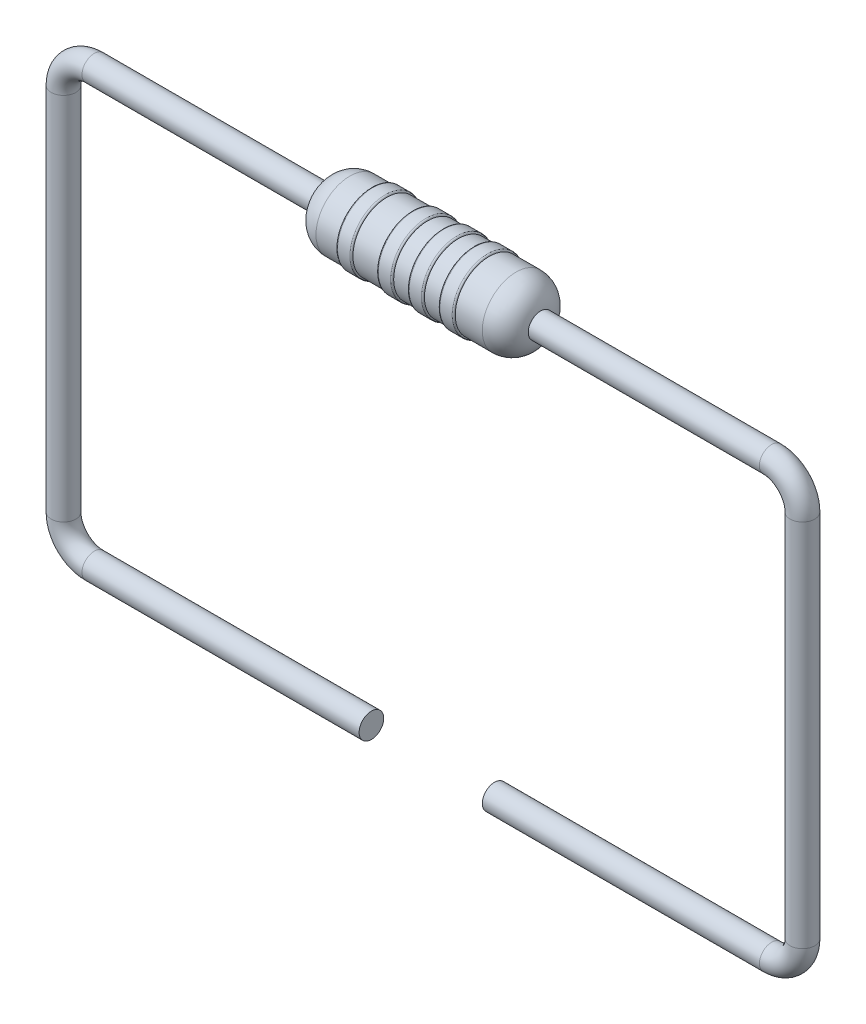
ISO-10303-21;
HEADER;
FILE_DESCRIPTION(('STEP AP214'),'2;1');
FILE_NAME('part.step','',(''),(''),'','','');
FILE_SCHEMA(('AUTOMOTIVE_DESIGN { 1 0 10303 214 1 1 1 1 }'));
ENDSEC;
DATA;
#1=APPLICATION_CONTEXT('core data for automotive mechanical design processes');
#2=APPLICATION_PROTOCOL_DEFINITION('international standard','automotive_design',2000,#1);
#3=PRODUCT_CONTEXT('',#1,'mechanical');
#4=PRODUCT('Part','Part','',(#3));
#5=PRODUCT_RELATED_PRODUCT_CATEGORY('part','',(#4));
#6=PRODUCT_DEFINITION_FORMATION('','',#4);
#7=PRODUCT_DEFINITION_CONTEXT('part definition',#1,'design');
#8=PRODUCT_DEFINITION('design','',#6,#7);
#9=PRODUCT_DEFINITION_SHAPE('','',#8);
#10=(LENGTH_UNIT() NAMED_UNIT(*) SI_UNIT(.MILLI.,.METRE.));
#11=(NAMED_UNIT(*) PLANE_ANGLE_UNIT() SI_UNIT($,.RADIAN.));
#12=(NAMED_UNIT(*) SI_UNIT($,.STERADIAN.) SOLID_ANGLE_UNIT());
#13=UNCERTAINTY_MEASURE_WITH_UNIT(LENGTH_MEASURE(1.E-05),#10,'distance_accuracy_value','');
#14=(GEOMETRIC_REPRESENTATION_CONTEXT(3) GLOBAL_UNCERTAINTY_ASSIGNED_CONTEXT((#13)) GLOBAL_UNIT_ASSIGNED_CONTEXT((#10,
#11,#12)) REPRESENTATION_CONTEXT('',''));
#15=CARTESIAN_POINT('',(0.,0.,0.));
#16=DIRECTION('',(0.,0.,1.));
#17=DIRECTION('',(1.,0.,0.));
#18=AXIS2_PLACEMENT_3D('',#15,#16,#17);
#19=CARTESIAN_POINT('',(-54.2686615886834,0.,0.));
#20=DIRECTION('',(-1.,0.,0.));
#21=DIRECTION('',(0.,0.,1.));
#22=AXIS2_PLACEMENT_3D('',#19,#20,#21);
#23=CYLINDRICAL_SURFACE('',#22,1.1);
#24=CARTESIAN_POINT('',(0.322975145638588,0.,0.));
#25=DIRECTION('',(-1.,0.,0.));
#26=DIRECTION('',(0.,0.,1.));
#27=AXIS2_PLACEMENT_3D('',#24,#25,#26);
#28=CIRCLE('',#27,1.1);
#29=CARTESIAN_POINT('',(0.322975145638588,0.,1.1));
#30=VERTEX_POINT('',#29);
#31=EDGE_CURVE('E104',#30,#30,#28,.T.);
#32=ORIENTED_EDGE('',*,*,#31,.T.);
#33=EDGE_LOOP('',(#32));
#34=FACE_BOUND('',#33,.T.);
#35=CARTESIAN_POINT('',(-0.177024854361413,0.,0.));
#36=DIRECTION('',(1.,0.,0.));
#37=DIRECTION('',(0.,0.,-1.));
#38=AXIS2_PLACEMENT_3D('',#35,#36,#37);
#39=CIRCLE('',#38,1.1);
#40=CARTESIAN_POINT('',(-0.177024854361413,0.,-1.1));
#41=VERTEX_POINT('',#40);
#42=EDGE_CURVE('E116',#41,#41,#39,.T.);
#43=ORIENTED_EDGE('',*,*,#42,.T.);
#44=EDGE_LOOP('',(#43));
#45=FACE_BOUND('',#44,.T.);
#46=ADVANCED_FACE('F49',(#34,#45),#23,.T.);
#47=CARTESIAN_POINT('',(4.3261723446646,0.,0.));
#48=DIRECTION('',(1.,0.,0.));
#49=DIRECTION('',(0.,0.,-1.));
#50=AXIS2_PLACEMENT_3D('',#47,#48,#49);
#51=CYLINDRICAL_SURFACE('',#50,1.15);
#52=CARTESIAN_POINT('',(-0.627024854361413,0.,0.));
#53=DIRECTION('',(-1.,0.,0.));
#54=DIRECTION('',(0.,0.,1.));
#55=AXIS2_PLACEMENT_3D('',#52,#53,#54);
#56=CIRCLE('',#55,1.15);
#57=CARTESIAN_POINT('',(-0.627024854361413,0.,1.15));
#58=VERTEX_POINT('',#57);
#59=EDGE_CURVE('E73',#58,#58,#56,.F.);
#60=ORIENTED_EDGE('',*,*,#59,.T.);
#61=EDGE_LOOP('',(#60));
#62=FACE_BOUND('',#61,.T.);
#63=CARTESIAN_POINT('',(-0.227024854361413,0.,0.));
#64=DIRECTION('',(1.,0.,0.));
#65=DIRECTION('',(0.,0.,-1.));
#66=AXIS2_PLACEMENT_3D('',#63,#64,#65);
#67=CIRCLE('',#66,1.15);
#68=CARTESIAN_POINT('',(-0.227024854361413,0.,-1.15));
#69=VERTEX_POINT('',#68);
#70=EDGE_CURVE('E77',#69,#69,#67,.F.);
#71=ORIENTED_EDGE('',*,*,#70,.T.);
#72=EDGE_LOOP('',(#71));
#73=FACE_BOUND('',#72,.T.);
#74=ADVANCED_FACE('F194',(#62,#73),#51,.T.);
#75=CARTESIAN_POINT('',(-1.5,0.,0.));
#76=DIRECTION('',(1.,0.,0.));
#77=DIRECTION('',(0.,0.,-1.));
#78=AXIS2_PLACEMENT_3D('',#75,#76,#77);
#79=CIRCLE('',#78,1.1);
#80=CARTESIAN_POINT('',(-1.5,0.,-1.1));
#81=VERTEX_POINT('',#80);
#82=EDGE_CURVE('E95',#81,#81,#79,.T.);
#83=ORIENTED_EDGE('',*,*,#82,.T.);
#84=EDGE_LOOP('',(#83));
#85=FACE_BOUND('',#84,.T.);
#86=CARTESIAN_POINT('',(-0.677024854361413,0.,0.));
#87=DIRECTION('',(-1.,0.,0.));
#88=DIRECTION('',(0.,0.,1.));
#89=AXIS2_PLACEMENT_3D('',#86,#87,#88);
#90=CIRCLE('',#89,1.1);
#91=CARTESIAN_POINT('',(-0.677024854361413,0.,1.1));
#92=VERTEX_POINT('',#91);
#93=EDGE_CURVE('E112',#92,#92,#90,.T.);
#94=ORIENTED_EDGE('',*,*,#93,.T.);
#95=EDGE_LOOP('',(#94));
#96=FACE_BOUND('',#95,.T.);
#97=ADVANCED_FACE('F197',(#85,#96),#23,.T.);
#98=CARTESIAN_POINT('',(4.3261723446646,0.,0.));
#99=DIRECTION('',(1.,0.,0.));
#100=DIRECTION('',(0.,0.,-1.));
#101=AXIS2_PLACEMENT_3D('',#98,#99,#100);
#102=CYLINDRICAL_SURFACE('',#101,1.15);
#103=CARTESIAN_POINT('',(0.372975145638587,0.,0.));
#104=DIRECTION('',(-1.,0.,0.));
#105=DIRECTION('',(0.,0.,1.));
#106=AXIS2_PLACEMENT_3D('',#103,#104,#105);
#107=CIRCLE('',#106,1.15);
#108=CARTESIAN_POINT('',(0.372975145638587,0.,1.15));
#109=VERTEX_POINT('',#108);
#110=EDGE_CURVE('E63',#109,#109,#107,.F.);
#111=ORIENTED_EDGE('',*,*,#110,.T.);
#112=EDGE_LOOP('',(#111));
#113=FACE_BOUND('',#112,.T.);
#114=CARTESIAN_POINT('',(0.772975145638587,0.,0.));
#115=DIRECTION('',(1.,0.,0.));
#116=DIRECTION('',(0.,0.,-1.));
#117=AXIS2_PLACEMENT_3D('',#114,#115,#116);
#118=CIRCLE('',#117,1.15);
#119=CARTESIAN_POINT('',(0.772975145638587,0.,-1.15));
#120=VERTEX_POINT('',#119);
#121=EDGE_CURVE('E69',#120,#120,#118,.F.);
#122=ORIENTED_EDGE('',*,*,#121,.T.);
#123=EDGE_LOOP('',(#122));
#124=FACE_BOUND('',#123,.T.);
#125=ADVANCED_FACE('F208',(#113,#124),#102,.T.);
#126=CARTESIAN_POINT('',(1.32297514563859,0.,0.));
#127=DIRECTION('',(-1.,0.,0.));
#128=DIRECTION('',(0.,0.,1.));
#129=AXIS2_PLACEMENT_3D('',#126,#127,#128);
#130=CIRCLE('',#129,1.1);
#131=CARTESIAN_POINT('',(1.32297514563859,0.,1.1));
#132=VERTEX_POINT('',#131);
#133=EDGE_CURVE('E94',#132,#132,#130,.T.);
#134=ORIENTED_EDGE('',*,*,#133,.T.);
#135=EDGE_LOOP('',(#134));
#136=FACE_BOUND('',#135,.T.);
#137=CARTESIAN_POINT('',(0.822975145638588,0.,0.));
#138=DIRECTION('',(1.,0.,0.));
#139=DIRECTION('',(0.,0.,-1.));
#140=AXIS2_PLACEMENT_3D('',#137,#138,#139);
#141=CIRCLE('',#140,1.1);
#142=CARTESIAN_POINT('',(0.822975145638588,0.,-1.1));
#143=VERTEX_POINT('',#142);
#144=EDGE_CURVE('E108',#143,#143,#141,.T.);
#145=ORIENTED_EDGE('',*,*,#144,.T.);
#146=EDGE_LOOP('',(#145));
#147=FACE_BOUND('',#146,.T.);
#148=ADVANCED_FACE('F198',(#136,#147),#23,.T.);
#149=CARTESIAN_POINT('',(4.3261723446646,0.,0.));
#150=DIRECTION('',(1.,0.,0.));
#151=DIRECTION('',(0.,0.,-1.));
#152=AXIS2_PLACEMENT_3D('',#149,#150,#151);
#153=CYLINDRICAL_SURFACE('',#152,1.15);
#154=CARTESIAN_POINT('',(1.37297514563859,0.,0.));
#155=DIRECTION('',(-1.,0.,0.));
#156=DIRECTION('',(0.,0.,1.));
#157=AXIS2_PLACEMENT_3D('',#154,#155,#156);
#158=CIRCLE('',#157,1.15);
#159=CARTESIAN_POINT('',(1.37297514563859,0.,1.15));
#160=VERTEX_POINT('',#159);
#161=EDGE_CURVE('E10',#160,#160,#158,.F.);
#162=ORIENTED_EDGE('',*,*,#161,.T.);
#163=EDGE_LOOP('',(#162));
#164=FACE_BOUND('',#163,.T.);
#165=CARTESIAN_POINT('',(1.77297514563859,0.,0.));
#166=DIRECTION('',(1.,0.,0.));
#167=DIRECTION('',(0.,0.,-1.));
#168=AXIS2_PLACEMENT_3D('',#165,#166,#167);
#169=CIRCLE('',#168,1.15);
#170=CARTESIAN_POINT('',(1.77297514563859,0.,-1.15));
#171=VERTEX_POINT('',#170);
#172=EDGE_CURVE('E58',#171,#171,#169,.F.);
#173=ORIENTED_EDGE('',*,*,#172,.T.);
#174=EDGE_LOOP('',(#173));
#175=FACE_BOUND('',#174,.T.);
#176=ADVANCED_FACE('F212',(#164,#175),#153,.T.);
#177=CARTESIAN_POINT('',(2.7,0.,0.));
#178=DIRECTION('',(-1.,0.,0.));
#179=DIRECTION('',(0.,0.,1.));
#180=AXIS2_PLACEMENT_3D('',#177,#178,#179);
#181=DEGENERATE_TOROIDAL_SURFACE('',#180,0.3,0.8,.T.);
#182=CARTESIAN_POINT('',(3.49372539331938,0.,0.));
#183=DIRECTION('',(-1.,0.,0.));
#184=DIRECTION('',(0.,0.,1.));
#185=AXIS2_PLACEMENT_3D('',#182,#183,#184);
#186=CIRCLE('',#185,0.4);
#187=CARTESIAN_POINT('',(3.49372539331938,0.,0.4));
#188=VERTEX_POINT('',#187);
#189=EDGE_CURVE('E99',#188,#188,#186,.T.);
#190=ORIENTED_EDGE('',*,*,#189,.T.);
#191=EDGE_LOOP('',(#190));
#192=FACE_BOUND('',#191,.T.);
#193=CARTESIAN_POINT('',(2.69999999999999,0.,0.));
#194=DIRECTION('',(-1.,0.,0.));
#195=DIRECTION('',(0.,0.,1.));
#196=AXIS2_PLACEMENT_3D('',#193,#194,#195);
#197=CIRCLE('',#196,1.1);
#198=CARTESIAN_POINT('',(2.69999999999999,0.,1.1));
#199=VERTEX_POINT('',#198);
#200=EDGE_CURVE('E89',#199,#199,#197,.T.);
#201=ORIENTED_EDGE('',*,*,#200,.F.);
#202=EDGE_LOOP('',(#201));
#203=FACE_BOUND('',#202,.T.);
#204=ADVANCED_FACE('F219',(#192,#203),#181,.T.);
#205=CARTESIAN_POINT('',(1.82297514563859,0.,0.));
#206=DIRECTION('',(1.,0.,0.));
#207=DIRECTION('',(0.,0.,-1.));
#208=AXIS2_PLACEMENT_3D('',#205,#206,#207);
#209=CIRCLE('',#208,1.1);
#210=CARTESIAN_POINT('',(1.82297514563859,0.,-1.1));
#211=VERTEX_POINT('',#210);
#212=EDGE_CURVE('E100',#211,#211,#209,.T.);
#213=ORIENTED_EDGE('',*,*,#212,.T.);
#214=EDGE_LOOP('',(#213));
#215=FACE_BOUND('',#214,.T.);
#216=ORIENTED_EDGE('',*,*,#200,.T.);
#217=EDGE_LOOP('',(#216));
#218=FACE_BOUND('',#217,.T.);
#219=ADVANCED_FACE('F214',(#215,#218),#23,.T.);
#220=CARTESIAN_POINT('',(4.3261723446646,0.,0.));
#221=DIRECTION('',(1.,0.,0.));
#222=DIRECTION('',(0.,0.,-1.));
#223=AXIS2_PLACEMENT_3D('',#220,#221,#222);
#224=CYLINDRICAL_SURFACE('',#223,1.15);
#225=CARTESIAN_POINT('',(-1.95,0.,0.));
#226=DIRECTION('',(-1.,0.,0.));
#227=DIRECTION('',(0.,0.,1.));
#228=AXIS2_PLACEMENT_3D('',#225,#226,#227);
#229=CIRCLE('',#228,1.15);
#230=CARTESIAN_POINT('',(-1.95,0.,1.15));
#231=VERTEX_POINT('',#230);
#232=EDGE_CURVE('E81',#231,#231,#229,.F.);
#233=ORIENTED_EDGE('',*,*,#232,.T.);
#234=EDGE_LOOP('',(#233));
#235=FACE_BOUND('',#234,.T.);
#236=CARTESIAN_POINT('',(-1.55,0.,0.));
#237=DIRECTION('',(1.,0.,0.));
#238=DIRECTION('',(0.,0.,-1.));
#239=AXIS2_PLACEMENT_3D('',#236,#237,#238);
#240=CIRCLE('',#239,1.15);
#241=CARTESIAN_POINT('',(-1.55,0.,-1.15));
#242=VERTEX_POINT('',#241);
#243=EDGE_CURVE('E85',#242,#242,#240,.F.);
#244=ORIENTED_EDGE('',*,*,#243,.T.);
#245=EDGE_LOOP('',(#244));
#246=FACE_BOUND('',#245,.T.);
#247=ADVANCED_FACE('F225',(#235,#246),#224,.T.);
#248=CARTESIAN_POINT('',(-2.7,0.,0.));
#249=DIRECTION('',(-1.,0.,0.));
#250=DIRECTION('',(0.,0.,1.));
#251=AXIS2_PLACEMENT_3D('',#248,#249,#250);
#252=DEGENERATE_TOROIDAL_SURFACE('',#251,0.3,0.8,.T.);
#253=CARTESIAN_POINT('',(-3.49372539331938,0.,0.));
#254=DIRECTION('',(1.,0.,0.));
#255=DIRECTION('',(0.,0.,-1.));
#256=AXIS2_PLACEMENT_3D('',#253,#254,#255);
#257=CIRCLE('',#256,0.4);
#258=CARTESIAN_POINT('',(-3.49372539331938,0.,-0.4));
#259=VERTEX_POINT('',#258);
#260=EDGE_CURVE('E53',#259,#259,#257,.T.);
#261=ORIENTED_EDGE('',*,*,#260,.T.);
#262=EDGE_LOOP('',(#261));
#263=FACE_BOUND('',#262,.T.);
#264=CARTESIAN_POINT('',(-2.69999999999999,0.,0.));
#265=DIRECTION('',(-1.,0.,0.));
#266=DIRECTION('',(0.,0.,1.));
#267=AXIS2_PLACEMENT_3D('',#264,#265,#266);
#268=CIRCLE('',#267,1.1);
#269=CARTESIAN_POINT('',(-2.69999999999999,0.,1.1));
#270=VERTEX_POINT('',#269);
#271=EDGE_CURVE('E120',#270,#270,#268,.T.);
#272=ORIENTED_EDGE('',*,*,#271,.T.);
#273=EDGE_LOOP('',(#272));
#274=FACE_BOUND('',#273,.T.);
#275=ADVANCED_FACE('F231',(#263,#274),#252,.T.);
#276=CARTESIAN_POINT('',(-2.,0.,0.));
#277=DIRECTION('',(-1.,0.,0.));
#278=DIRECTION('',(0.,0.,1.));
#279=AXIS2_PLACEMENT_3D('',#276,#277,#278);
#280=CIRCLE('',#279,1.1);
#281=CARTESIAN_POINT('',(-2.,0.,1.1));
#282=VERTEX_POINT('',#281);
#283=EDGE_CURVE('E90',#282,#282,#280,.T.);
#284=ORIENTED_EDGE('',*,*,#283,.T.);
#285=EDGE_LOOP('',(#284));
#286=FACE_BOUND('',#285,.T.);
#287=ORIENTED_EDGE('',*,*,#271,.F.);
#288=EDGE_LOOP('',(#287));
#289=FACE_BOUND('',#288,.T.);
#290=ADVANCED_FACE('F210',(#286,#289),#23,.T.);
#291=CARTESIAN_POINT('',(-1.95,0.,0.));
#292=DIRECTION('',(-1.,0.,0.));
#293=DIRECTION('',(0.,0.,1.));
#294=AXIS2_PLACEMENT_3D('',#291,#292,#293);
#295=TOROIDAL_SURFACE('',#294,1.1,0.05);
#296=ORIENTED_EDGE('',*,*,#283,.F.);
#297=EDGE_LOOP('',(#296));
#298=FACE_BOUND('',#297,.T.);
#299=ORIENTED_EDGE('',*,*,#232,.F.);
#300=EDGE_LOOP('',(#299));
#301=FACE_BOUND('',#300,.T.);
#302=ADVANCED_FACE('F236',(#298,#301),#295,.T.);
#303=CARTESIAN_POINT('',(-1.55,0.,0.));
#304=DIRECTION('',(1.,0.,0.));
#305=DIRECTION('',(0.,0.,-1.));
#306=AXIS2_PLACEMENT_3D('',#303,#304,#305);
#307=TOROIDAL_SURFACE('',#306,1.1,0.05);
#308=ORIENTED_EDGE('',*,*,#243,.F.);
#309=EDGE_LOOP('',(#308));
#310=FACE_BOUND('',#309,.T.);
#311=ORIENTED_EDGE('',*,*,#82,.F.);
#312=EDGE_LOOP('',(#311));
#313=FACE_BOUND('',#312,.T.);
#314=ADVANCED_FACE('F242',(#310,#313),#307,.T.);
#315=CARTESIAN_POINT('',(-0.627024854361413,0.,0.));
#316=DIRECTION('',(-1.,0.,0.));
#317=DIRECTION('',(0.,0.,1.));
#318=AXIS2_PLACEMENT_3D('',#315,#316,#317);
#319=TOROIDAL_SURFACE('',#318,1.1,0.05);
#320=ORIENTED_EDGE('',*,*,#93,.F.);
#321=EDGE_LOOP('',(#320));
#322=FACE_BOUND('',#321,.T.);
#323=ORIENTED_EDGE('',*,*,#59,.F.);
#324=EDGE_LOOP('',(#323));
#325=FACE_BOUND('',#324,.T.);
#326=ADVANCED_FACE('F257',(#322,#325),#319,.T.);
#327=CARTESIAN_POINT('',(-0.227024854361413,0.,0.));
#328=DIRECTION('',(1.,0.,0.));
#329=DIRECTION('',(0.,0.,-1.));
#330=AXIS2_PLACEMENT_3D('',#327,#328,#329);
#331=TOROIDAL_SURFACE('',#330,1.1,0.05);
#332=ORIENTED_EDGE('',*,*,#70,.F.);
#333=EDGE_LOOP('',(#332));
#334=FACE_BOUND('',#333,.T.);
#335=ORIENTED_EDGE('',*,*,#42,.F.);
#336=EDGE_LOOP('',(#335));
#337=FACE_BOUND('',#336,.T.);
#338=ADVANCED_FACE('F265',(#334,#337),#331,.T.);
#339=CARTESIAN_POINT('',(0.372975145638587,0.,0.));
#340=DIRECTION('',(-1.,0.,0.));
#341=DIRECTION('',(0.,0.,1.));
#342=AXIS2_PLACEMENT_3D('',#339,#340,#341);
#343=TOROIDAL_SURFACE('',#342,1.1,0.05);
#344=ORIENTED_EDGE('',*,*,#31,.F.);
#345=EDGE_LOOP('',(#344));
#346=FACE_BOUND('',#345,.T.);
#347=ORIENTED_EDGE('',*,*,#110,.F.);
#348=EDGE_LOOP('',(#347));
#349=FACE_BOUND('',#348,.T.);
#350=ADVANCED_FACE('F273',(#346,#349),#343,.T.);
#351=CARTESIAN_POINT('',(0.772975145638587,0.,0.));
#352=DIRECTION('',(1.,0.,0.));
#353=DIRECTION('',(0.,0.,-1.));
#354=AXIS2_PLACEMENT_3D('',#351,#352,#353);
#355=TOROIDAL_SURFACE('',#354,1.1,0.05);
#356=ORIENTED_EDGE('',*,*,#121,.F.);
#357=EDGE_LOOP('',(#356));
#358=FACE_BOUND('',#357,.T.);
#359=ORIENTED_EDGE('',*,*,#144,.F.);
#360=EDGE_LOOP('',(#359));
#361=FACE_BOUND('',#360,.T.);
#362=ADVANCED_FACE('F279',(#358,#361),#355,.T.);
#363=CARTESIAN_POINT('',(1.37297514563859,0.,0.));
#364=DIRECTION('',(-1.,0.,0.));
#365=DIRECTION('',(0.,0.,1.));
#366=AXIS2_PLACEMENT_3D('',#363,#364,#365);
#367=TOROIDAL_SURFACE('',#366,1.1,0.05);
#368=ORIENTED_EDGE('',*,*,#133,.F.);
#369=EDGE_LOOP('',(#368));
#370=FACE_BOUND('',#369,.T.);
#371=ORIENTED_EDGE('',*,*,#161,.F.);
#372=EDGE_LOOP('',(#371));
#373=FACE_BOUND('',#372,.T.);
#374=ADVANCED_FACE('F284',(#370,#373),#367,.T.);
#375=CARTESIAN_POINT('',(1.77297514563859,0.,0.));
#376=DIRECTION('',(1.,0.,0.));
#377=DIRECTION('',(0.,0.,-1.));
#378=AXIS2_PLACEMENT_3D('',#375,#376,#377);
#379=TOROIDAL_SURFACE('',#378,1.1,0.05);
#380=ORIENTED_EDGE('',*,*,#172,.F.);
#381=EDGE_LOOP('',(#380));
#382=FACE_BOUND('',#381,.T.);
#383=ORIENTED_EDGE('',*,*,#212,.F.);
#384=EDGE_LOOP('',(#383));
#385=FACE_BOUND('',#384,.T.);
#386=ADVANCED_FACE('F51',(#382,#385),#379,.T.);
#387=CARTESIAN_POINT('',(-2.,-14.,0.));
#388=DIRECTION('',(1.,0.,0.));
#389=DIRECTION('',(0.,0.,-1.));
#390=AXIS2_PLACEMENT_3D('',#387,#388,#389);
#391=PLANE('',#390);
#392=CARTESIAN_POINT('',(-2.,-14.,0.));
#393=DIRECTION('',(1.,0.,0.));
#394=DIRECTION('',(0.,0.,-1.));
#395=AXIS2_PLACEMENT_3D('',#392,#393,#394);
#396=CIRCLE('',#395,0.4);
#397=CARTESIAN_POINT('',(-2.,-14.,-0.4));
#398=VERTEX_POINT('',#397);
#399=EDGE_CURVE('E133',#398,#398,#396,.T.);
#400=ORIENTED_EDGE('',*,*,#399,.T.);
#401=EDGE_LOOP('',(#400));
#402=FACE_BOUND('',#401,.T.);
#403=ADVANCED_FACE('F291',(#402),#391,.T.);
#404=CARTESIAN_POINT('',(-11.,-14.,0.));
#405=DIRECTION('',(1.,0.,0.));
#406=DIRECTION('',(0.,1.,0.));
#407=AXIS2_PLACEMENT_3D('',#404,#405,#406);
#408=CYLINDRICAL_SURFACE('',#407,0.4);
#409=ORIENTED_EDGE('',*,*,#399,.F.);
#410=EDGE_LOOP('',(#409));
#411=FACE_BOUND('',#410,.T.);
#412=CARTESIAN_POINT('',(-11.,-14.,0.));
#413=DIRECTION('',(1.,0.,0.));
#414=DIRECTION('',(0.,0.,-1.));
#415=AXIS2_PLACEMENT_3D('',#412,#413,#414);
#416=CIRCLE('',#415,0.4);
#417=CARTESIAN_POINT('',(-11.,-14.4,0.));
#418=VERTEX_POINT('',#417);
#419=EDGE_CURVE('E137',#418,#418,#416,.T.);
#420=ORIENTED_EDGE('',*,*,#419,.T.);
#421=EDGE_LOOP('',(#420));
#422=FACE_BOUND('',#421,.T.);
#423=ADVANCED_FACE('F298',(#411,#422),#408,.T.);
#424=CARTESIAN_POINT('',(-11.,-13.,0.));
#425=DIRECTION('',(0.,0.,1.));
#426=DIRECTION('',(1.,0.,0.));
#427=AXIS2_PLACEMENT_3D('',#424,#425,#426);
#428=TOROIDAL_SURFACE('',#427,1.,0.4);
#429=CARTESIAN_POINT('',(-12.,-13.,0.));
#430=DIRECTION('',(0.,-1.,0.));
#431=DIRECTION('',(0.,0.,-1.));
#432=AXIS2_PLACEMENT_3D('',#429,#430,#431);
#433=CIRCLE('',#432,0.4);
#434=CARTESIAN_POINT('',(-12.4,-13.,0.));
#435=VERTEX_POINT('',#434);
#436=EDGE_CURVE('E141',#435,#435,#433,.T.);
#437=CARTESIAN_POINT('',(-11.,-13.,0.));
#438=DIRECTION('',(0.,0.,1.));
#439=DIRECTION('',(1.,0.,0.));
#440=AXIS2_PLACEMENT_3D('',#437,#438,#439);
#441=CIRCLE('',#440,1.4);
#442=EDGE_CURVE('',#435,#418,#441,.T.);
#443=ORIENTED_EDGE('',*,*,#436,.T.);
#444=ORIENTED_EDGE('',*,*,#419,.F.);
#445=ORIENTED_EDGE('',*,*,#442,.T.);
#446=ORIENTED_EDGE('',*,*,#442,.F.);
#447=EDGE_LOOP('',(#443,#445,#444,#446));
#448=FACE_BOUND('',#447,.T.);
#449=ADVANCED_FACE('F308',(#448),#428,.T.);
#450=CARTESIAN_POINT('',(-12.,-1.,0.));
#451=DIRECTION('',(0.,-1.,0.));
#452=DIRECTION('',(0.,0.,-1.));
#453=AXIS2_PLACEMENT_3D('',#450,#451,#452);
#454=CYLINDRICAL_SURFACE('',#453,0.4);
#455=ORIENTED_EDGE('',*,*,#436,.F.);
#456=EDGE_LOOP('',(#455));
#457=FACE_BOUND('',#456,.T.);
#458=CARTESIAN_POINT('',(-12.,-1.,0.));
#459=DIRECTION('',(0.,-1.,0.));
#460=DIRECTION('',(0.,0.,-1.));
#461=AXIS2_PLACEMENT_3D('',#458,#459,#460);
#462=CIRCLE('',#461,0.4);
#463=CARTESIAN_POINT('',(-12.4,-0.999999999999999,0.));
#464=VERTEX_POINT('',#463);
#465=EDGE_CURVE('E145',#464,#464,#462,.T.);
#466=ORIENTED_EDGE('',*,*,#465,.T.);
#467=EDGE_LOOP('',(#466));
#468=FACE_BOUND('',#467,.T.);
#469=ADVANCED_FACE('F314',(#457,#468),#454,.T.);
#470=CARTESIAN_POINT('',(-11.,-1.,0.));
#471=DIRECTION('',(0.,0.,1.));
#472=DIRECTION('',(1.,0.,0.));
#473=AXIS2_PLACEMENT_3D('',#470,#471,#472);
#474=TOROIDAL_SURFACE('',#473,1.,0.4);
#475=CARTESIAN_POINT('',(-11.,0.,0.));
#476=DIRECTION('',(-1.,0.,0.));
#477=DIRECTION('',(0.,0.,-1.));
#478=AXIS2_PLACEMENT_3D('',#475,#476,#477);
#479=CIRCLE('',#478,0.4);
#480=CARTESIAN_POINT('',(-11.,0.400000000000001,0.));
#481=VERTEX_POINT('',#480);
#482=EDGE_CURVE('E149',#481,#481,#479,.T.);
#483=CARTESIAN_POINT('',(-11.,-1.,0.));
#484=DIRECTION('',(0.,0.,1.));
#485=DIRECTION('',(1.,0.,0.));
#486=AXIS2_PLACEMENT_3D('',#483,#484,#485);
#487=CIRCLE('',#486,1.4);
#488=EDGE_CURVE('',#481,#464,#487,.T.);
#489=ORIENTED_EDGE('',*,*,#482,.T.);
#490=ORIENTED_EDGE('',*,*,#465,.F.);
#491=ORIENTED_EDGE('',*,*,#488,.T.);
#492=ORIENTED_EDGE('',*,*,#488,.F.);
#493=EDGE_LOOP('',(#489,#491,#490,#492));
#494=FACE_BOUND('',#493,.T.);
#495=ADVANCED_FACE('F318',(#494),#474,.T.);
#496=CARTESIAN_POINT('',(11.,0.,0.));
#497=DIRECTION('',(-1.,0.,0.));
#498=DIRECTION('',(0.,0.,1.));
#499=AXIS2_PLACEMENT_3D('',#496,#497,#498);
#500=CYLINDRICAL_SURFACE('',#499,0.4);
#501=ORIENTED_EDGE('',*,*,#482,.F.);
#502=EDGE_LOOP('',(#501));
#503=FACE_BOUND('',#502,.T.);
#504=ORIENTED_EDGE('',*,*,#260,.F.);
#505=EDGE_LOOP('',(#504));
#506=FACE_BOUND('',#505,.T.);
#507=ADVANCED_FACE('F187',(#503,#506),#500,.T.);
#508=CARTESIAN_POINT('',(11.,0.,0.));
#509=DIRECTION('',(-1.,0.,0.));
#510=DIRECTION('',(0.,0.,-1.));
#511=AXIS2_PLACEMENT_3D('',#508,#509,#510);
#512=CIRCLE('',#511,0.4);
#513=CARTESIAN_POINT('',(11.,0.400000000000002,0.));
#514=VERTEX_POINT('',#513);
#515=EDGE_CURVE('E153',#514,#514,#512,.T.);
#516=ORIENTED_EDGE('',*,*,#515,.T.);
#517=EDGE_LOOP('',(#516));
#518=FACE_BOUND('',#517,.T.);
#519=ORIENTED_EDGE('',*,*,#189,.F.);
#520=EDGE_LOOP('',(#519));
#521=FACE_BOUND('',#520,.T.);
#522=ADVANCED_FACE('F178',(#518,#521),#500,.T.);
#523=CARTESIAN_POINT('',(1.99999999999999,-14.,0.));
#524=DIRECTION('',(1.,0.,0.));
#525=DIRECTION('',(0.,0.,-1.));
#526=AXIS2_PLACEMENT_3D('',#523,#524,#525);
#527=PLANE('',#526);
#528=CARTESIAN_POINT('',(1.99999999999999,-14.,0.));
#529=DIRECTION('',(1.,0.,0.));
#530=DIRECTION('',(0.,0.,-1.));
#531=AXIS2_PLACEMENT_3D('',#528,#529,#530);
#532=CIRCLE('',#531,0.4);
#533=CARTESIAN_POINT('',(1.99999999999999,-14.,-0.4));
#534=VERTEX_POINT('',#533);
#535=EDGE_CURVE('E169',#534,#534,#532,.T.);
#536=ORIENTED_EDGE('',*,*,#535,.F.);
#537=EDGE_LOOP('',(#536));
#538=FACE_BOUND('',#537,.T.);
#539=ADVANCED_FACE('F176',(#538),#527,.F.);
#540=CARTESIAN_POINT('',(1.99999999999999,-14.,0.));
#541=DIRECTION('',(1.,0.,0.));
#542=DIRECTION('',(0.,1.,0.));
#543=AXIS2_PLACEMENT_3D('',#540,#541,#542);
#544=CYLINDRICAL_SURFACE('',#543,0.4);
#545=CARTESIAN_POINT('',(11.,-14.,0.));
#546=DIRECTION('',(1.,0.,0.));
#547=DIRECTION('',(0.,0.,-1.));
#548=AXIS2_PLACEMENT_3D('',#545,#546,#547);
#549=CIRCLE('',#548,0.4);
#550=CARTESIAN_POINT('',(11.,-14.4,0.));
#551=VERTEX_POINT('',#550);
#552=EDGE_CURVE('E165',#551,#551,#549,.T.);
#553=ORIENTED_EDGE('',*,*,#552,.F.);
#554=EDGE_LOOP('',(#553));
#555=FACE_BOUND('',#554,.T.);
#556=ORIENTED_EDGE('',*,*,#535,.T.);
#557=EDGE_LOOP('',(#556));
#558=FACE_BOUND('',#557,.T.);
#559=ADVANCED_FACE('F174',(#555,#558),#544,.T.);
#560=CARTESIAN_POINT('',(11.,-13.,0.));
#561=DIRECTION('',(0.,0.,1.));
#562=DIRECTION('',(1.,0.,0.));
#563=AXIS2_PLACEMENT_3D('',#560,#561,#562);
#564=TOROIDAL_SURFACE('',#563,0.999999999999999,0.4);
#565=CARTESIAN_POINT('',(12.,-13.,0.));
#566=DIRECTION('',(0.,1.,0.));
#567=DIRECTION('',(0.,0.,-1.));
#568=AXIS2_PLACEMENT_3D('',#565,#566,#567);
#569=CIRCLE('',#568,0.4);
#570=CARTESIAN_POINT('',(12.4,-13.,0.));
#571=VERTEX_POINT('',#570);
#572=EDGE_CURVE('E161',#571,#571,#569,.T.);
#573=CARTESIAN_POINT('',(11.,-13.,0.));
#574=DIRECTION('',(0.,0.,1.));
#575=DIRECTION('',(1.,0.,0.));
#576=AXIS2_PLACEMENT_3D('',#573,#574,#575);
#577=CIRCLE('',#576,1.4);
#578=EDGE_CURVE('',#551,#571,#577,.T.);
#579=ORIENTED_EDGE('',*,*,#552,.T.);
#580=ORIENTED_EDGE('',*,*,#572,.F.);
#581=ORIENTED_EDGE('',*,*,#578,.T.);
#582=ORIENTED_EDGE('',*,*,#578,.F.);
#583=EDGE_LOOP('',(#579,#581,#580,#582));
#584=FACE_BOUND('',#583,.T.);
#585=ADVANCED_FACE('F184',(#584),#564,.T.);
#586=CARTESIAN_POINT('',(12.,-13.,0.));
#587=DIRECTION('',(0.,1.,0.));
#588=DIRECTION('',(0.,0.,1.));
#589=AXIS2_PLACEMENT_3D('',#586,#587,#588);
#590=CYLINDRICAL_SURFACE('',#589,0.4);
#591=CARTESIAN_POINT('',(12.,-1.,0.));
#592=DIRECTION('',(0.,1.,0.));
#593=DIRECTION('',(0.,0.,-1.));
#594=AXIS2_PLACEMENT_3D('',#591,#592,#593);
#595=CIRCLE('',#594,0.4);
#596=CARTESIAN_POINT('',(12.4,-1.,0.));
#597=VERTEX_POINT('',#596);
#598=EDGE_CURVE('E157',#597,#597,#595,.T.);
#599=ORIENTED_EDGE('',*,*,#598,.F.);
#600=EDGE_LOOP('',(#599));
#601=FACE_BOUND('',#600,.T.);
#602=ORIENTED_EDGE('',*,*,#572,.T.);
#603=EDGE_LOOP('',(#602));
#604=FACE_BOUND('',#603,.T.);
#605=ADVANCED_FACE('F325',(#601,#604),#590,.T.);
#606=CARTESIAN_POINT('',(11.,-1.,0.));
#607=DIRECTION('',(0.,0.,1.));
#608=DIRECTION('',(1.,0.,0.));
#609=AXIS2_PLACEMENT_3D('',#606,#607,#608);
#610=TOROIDAL_SURFACE('',#609,1.,0.4);
#611=CARTESIAN_POINT('',(11.,-1.,0.));
#612=DIRECTION('',(0.,0.,1.));
#613=DIRECTION('',(1.,0.,0.));
#614=AXIS2_PLACEMENT_3D('',#611,#612,#613);
#615=CIRCLE('',#614,1.4);
#616=EDGE_CURVE('',#597,#514,#615,.T.);
#617=ORIENTED_EDGE('',*,*,#598,.T.);
#618=ORIENTED_EDGE('',*,*,#515,.F.);
#619=ORIENTED_EDGE('',*,*,#616,.T.);
#620=ORIENTED_EDGE('',*,*,#616,.F.);
#621=EDGE_LOOP('',(#617,#619,#618,#620));
#622=FACE_BOUND('',#621,.T.);
#623=ADVANCED_FACE('F190',(#622),#610,.T.);
#624=CLOSED_SHELL('',(#46,#74,#97,#125,#148,#176,#204,#219,#247,#275,#290,#302,#314,#326,#338,
#350,#362,#374,#386,#403,#423,#449,#469,#495,#507,#522,#539,#559,#585,#605,#623));
#625=MANIFOLD_SOLID_BREP('B2',#624);
#626=ADVANCED_BREP_SHAPE_REPRESENTATION('',(#18,#625),#14);
#627=SHAPE_DEFINITION_REPRESENTATION(#9,#626);
ENDSEC;
END-ISO-10303-21;
